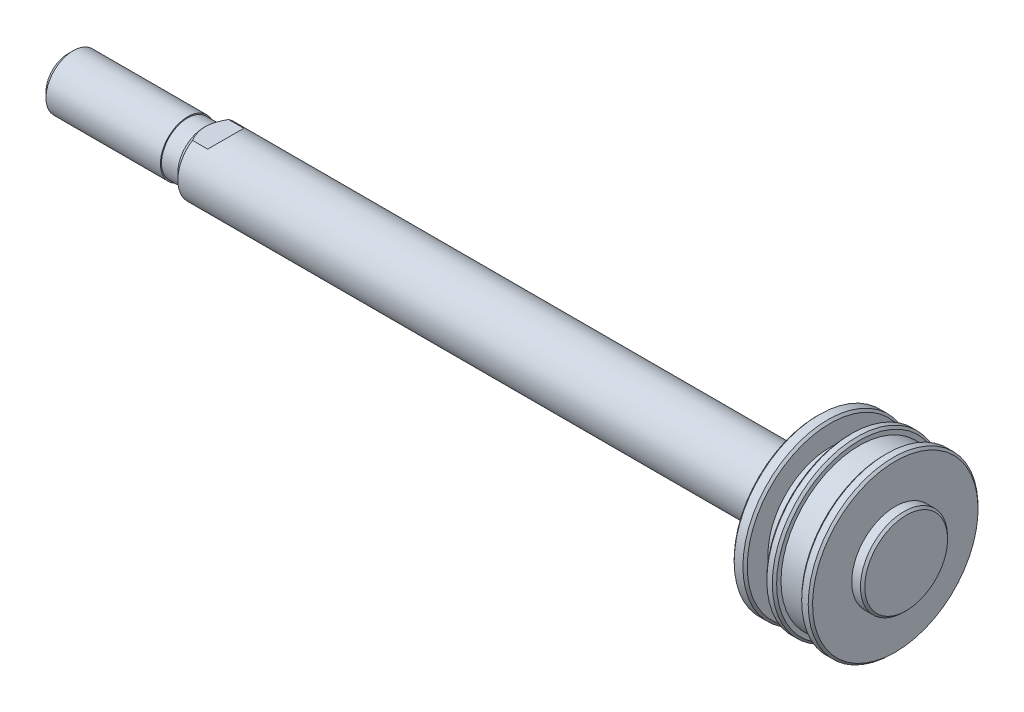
ISO-10303-21;
HEADER;
FILE_DESCRIPTION(('STEP AP214'),'2;1');
FILE_NAME('part.step','',(''),(''),'','','');
FILE_SCHEMA(('AUTOMOTIVE_DESIGN { 1 0 10303 214 1 1 1 1 }'));
ENDSEC;
DATA;
#1=APPLICATION_CONTEXT('core data for automotive mechanical design processes');
#2=APPLICATION_PROTOCOL_DEFINITION('international standard','automotive_design',2000,#1);
#3=PRODUCT_CONTEXT('',#1,'mechanical');
#4=PRODUCT('Part','Part','',(#3));
#5=PRODUCT_RELATED_PRODUCT_CATEGORY('part','',(#4));
#6=PRODUCT_DEFINITION_FORMATION('','',#4);
#7=PRODUCT_DEFINITION_CONTEXT('part definition',#1,'design');
#8=PRODUCT_DEFINITION('design','',#6,#7);
#9=PRODUCT_DEFINITION_SHAPE('','',#8);
#10=(LENGTH_UNIT() NAMED_UNIT(*) SI_UNIT(.MILLI.,.METRE.));
#11=(NAMED_UNIT(*) PLANE_ANGLE_UNIT() SI_UNIT($,.RADIAN.));
#12=(NAMED_UNIT(*) SI_UNIT($,.STERADIAN.) SOLID_ANGLE_UNIT());
#13=UNCERTAINTY_MEASURE_WITH_UNIT(LENGTH_MEASURE(1.E-05),#10,'distance_accuracy_value','');
#14=(GEOMETRIC_REPRESENTATION_CONTEXT(3) GLOBAL_UNCERTAINTY_ASSIGNED_CONTEXT((#13)) GLOBAL_UNIT_ASSIGNED_CONTEXT((#10,
#11,#12)) REPRESENTATION_CONTEXT('',''));
#15=CARTESIAN_POINT('',(0.,0.,0.));
#16=DIRECTION('',(0.,0.,1.));
#17=DIRECTION('',(1.,0.,0.));
#18=AXIS2_PLACEMENT_3D('',#15,#16,#17);
#19=CARTESIAN_POINT('',(61.,3.8,0.));
#20=DIRECTION('',(-1.,0.,0.));
#21=DIRECTION('',(0.,0.,1.));
#22=AXIS2_PLACEMENT_3D('',#19,#20,#21);
#23=PLANE('',#22);
#24=CARTESIAN_POINT('',(60.9999999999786,0.,0.));
#25=DIRECTION('',(-1.,0.,0.));
#26=DIRECTION('',(0.,0.,1.));
#27=AXIS2_PLACEMENT_3D('',#24,#25,#26);
#28=CIRCLE('',#27,3.80000000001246);
#29=CARTESIAN_POINT('',(60.9999999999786,0.,3.80000000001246));
#30=VERTEX_POINT('',#29);
#31=EDGE_CURVE('E20',#30,#30,#28,.T.);
#32=ORIENTED_EDGE('',*,*,#31,.F.);
#33=EDGE_LOOP('',(#32));
#34=FACE_BOUND('',#33,.T.);
#35=ADVANCED_FACE('F17',(#34),#23,.F.);
#36=CARTESIAN_POINT('',(60.8000000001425,0.,0.));
#37=DIRECTION('',(-1.,0.,0.));
#38=DIRECTION('',(0.,0.,1.));
#39=AXIS2_PLACEMENT_3D('',#36,#37,#38);
#40=CONICAL_SURFACE('',#39,3.99999999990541,0.785398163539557);
#41=CARTESIAN_POINT('',(60.8,0.,0.));
#42=DIRECTION('',(-1.,0.,0.));
#43=DIRECTION('',(0.,0.,1.));
#44=AXIS2_PLACEMENT_3D('',#41,#42,#43);
#45=CIRCLE('',#44,4.);
#46=CARTESIAN_POINT('',(60.8,0.,4.));
#47=VERTEX_POINT('',#46);
#48=EDGE_CURVE('E86',#47,#47,#45,.T.);
#49=ORIENTED_EDGE('',*,*,#48,.F.);
#50=EDGE_LOOP('',(#49));
#51=FACE_BOUND('',#50,.T.);
#52=ORIENTED_EDGE('',*,*,#31,.T.);
#53=EDGE_LOOP('',(#52));
#54=FACE_BOUND('',#53,.T.);
#55=ADVANCED_FACE('F210',(#51,#54),#40,.T.);
#56=CARTESIAN_POINT('',(61.,0.,0.));
#57=DIRECTION('',(-1.,0.,0.));
#58=DIRECTION('',(0.,0.,1.));
#59=AXIS2_PLACEMENT_3D('',#56,#57,#58);
#60=CYLINDRICAL_SURFACE('',#59,4.);
#61=CARTESIAN_POINT('',(60.,0.,0.));
#62=DIRECTION('',(-1.,0.,0.));
#63=DIRECTION('',(0.,0.,1.));
#64=AXIS2_PLACEMENT_3D('',#61,#62,#63);
#65=CIRCLE('',#64,4.);
#66=CARTESIAN_POINT('',(60.,0.,4.));
#67=VERTEX_POINT('',#66);
#68=EDGE_CURVE('E519',#67,#67,#65,.F.);
#69=ORIENTED_EDGE('',*,*,#68,.T.);
#70=EDGE_LOOP('',(#69));
#71=FACE_BOUND('',#70,.T.);
#72=ORIENTED_EDGE('',*,*,#48,.T.);
#73=EDGE_LOOP('',(#72));
#74=FACE_BOUND('',#73,.T.);
#75=ADVANCED_FACE('F207',(#71,#74),#60,.T.);
#76=CARTESIAN_POINT('',(60.,7.6,0.));
#77=DIRECTION('',(-1.,0.,0.));
#78=DIRECTION('',(0.,0.,1.));
#79=AXIS2_PLACEMENT_3D('',#76,#77,#78);
#80=PLANE('',#79);
#81=ORIENTED_EDGE('',*,*,#68,.F.);
#82=EDGE_LOOP('',(#81));
#83=FACE_BOUND('',#82,.T.);
#84=CARTESIAN_POINT('',(60.,0.,0.));
#85=DIRECTION('',(-1.,0.,0.));
#86=DIRECTION('',(0.,-1.,0.));
#87=AXIS2_PLACEMENT_3D('',#84,#85,#86);
#88=CIRCLE('',#87,7.6);
#89=CARTESIAN_POINT('',(60.,-7.6,0.));
#90=VERTEX_POINT('',#89);
#91=EDGE_CURVE('E516',#90,#90,#88,.T.);
#92=ORIENTED_EDGE('',*,*,#91,.F.);
#93=EDGE_LOOP('',(#92));
#94=FACE_BOUND('',#93,.T.);
#95=ADVANCED_FACE('F203',(#83,#94),#80,.F.);
#96=CARTESIAN_POINT('',(59.8,0.,0.));
#97=DIRECTION('',(-1.,0.,0.));
#98=DIRECTION('',(0.,-1.,0.));
#99=AXIS2_PLACEMENT_3D('',#96,#97,#98);
#100=CONICAL_SURFACE('',#99,7.8,0.78539816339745);
#101=ORIENTED_EDGE('',*,*,#91,.T.);
#102=EDGE_LOOP('',(#101));
#103=FACE_BOUND('',#102,.T.);
#104=CARTESIAN_POINT('',(59.8,0.,0.));
#105=DIRECTION('',(-1.,0.,0.));
#106=DIRECTION('',(0.,0.,1.));
#107=AXIS2_PLACEMENT_3D('',#104,#105,#106);
#108=CIRCLE('',#107,7.8);
#109=CARTESIAN_POINT('',(59.8,0.,7.8));
#110=VERTEX_POINT('',#109);
#111=EDGE_CURVE('E518',#110,#110,#108,.T.);
#112=ORIENTED_EDGE('',*,*,#111,.F.);
#113=EDGE_LOOP('',(#112));
#114=FACE_BOUND('',#113,.T.);
#115=ADVANCED_FACE('F199',(#103,#114),#100,.T.);
#116=CARTESIAN_POINT('',(61.,0.,0.));
#117=DIRECTION('',(-1.,0.,0.));
#118=DIRECTION('',(0.,0.,1.));
#119=AXIS2_PLACEMENT_3D('',#116,#117,#118);
#120=CYLINDRICAL_SURFACE('',#119,7.8);
#121=ORIENTED_EDGE('',*,*,#111,.T.);
#122=EDGE_LOOP('',(#121));
#123=FACE_BOUND('',#122,.T.);
#124=CARTESIAN_POINT('',(59.2,0.,0.));
#125=DIRECTION('',(1.,0.,0.));
#126=DIRECTION('',(0.,0.,-1.));
#127=AXIS2_PLACEMENT_3D('',#124,#125,#126);
#128=CIRCLE('',#127,7.8);
#129=CARTESIAN_POINT('',(59.2,0.,-7.8));
#130=VERTEX_POINT('',#129);
#131=EDGE_CURVE('E515',#130,#130,#128,.F.);
#132=ORIENTED_EDGE('',*,*,#131,.F.);
#133=EDGE_LOOP('',(#132));
#134=FACE_BOUND('',#133,.T.);
#135=ADVANCED_FACE('F195',(#123,#134),#120,.T.);
#136=CARTESIAN_POINT('',(59.2,0.,0.));
#137=DIRECTION('',(1.,0.,0.));
#138=DIRECTION('',(0.,1.,0.));
#139=AXIS2_PLACEMENT_3D('',#136,#137,#138);
#140=CONICAL_SURFACE('',#139,7.8,0.785398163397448);
#141=CARTESIAN_POINT('',(59.,0.,0.));
#142=DIRECTION('',(1.,0.,0.));
#143=DIRECTION('',(0.,1.,0.));
#144=AXIS2_PLACEMENT_3D('',#141,#142,#143);
#145=CIRCLE('',#144,7.6);
#146=CARTESIAN_POINT('',(59.,7.6,0.));
#147=VERTEX_POINT('',#146);
#148=EDGE_CURVE('E512',#147,#147,#145,.T.);
#149=ORIENTED_EDGE('',*,*,#148,.T.);
#150=EDGE_LOOP('',(#149));
#151=FACE_BOUND('',#150,.T.);
#152=ORIENTED_EDGE('',*,*,#131,.T.);
#153=EDGE_LOOP('',(#152));
#154=FACE_BOUND('',#153,.T.);
#155=ADVANCED_FACE('F191',(#151,#154),#140,.T.);
#156=CARTESIAN_POINT('',(59.,7.2,0.));
#157=DIRECTION('',(1.,0.,0.));
#158=DIRECTION('',(0.,0.,-1.));
#159=AXIS2_PLACEMENT_3D('',#156,#157,#158);
#160=PLANE('',#159);
#161=ORIENTED_EDGE('',*,*,#148,.F.);
#162=EDGE_LOOP('',(#161));
#163=FACE_BOUND('',#162,.T.);
#164=CARTESIAN_POINT('',(59.,0.,0.));
#165=DIRECTION('',(-1.,0.,0.));
#166=DIRECTION('',(0.,0.,1.));
#167=AXIS2_PLACEMENT_3D('',#164,#165,#166);
#168=CIRCLE('',#167,7.2);
#169=CARTESIAN_POINT('',(59.,0.,7.2));
#170=VERTEX_POINT('',#169);
#171=EDGE_CURVE('E509',#170,#170,#168,.T.);
#172=ORIENTED_EDGE('',*,*,#171,.F.);
#173=EDGE_LOOP('',(#172));
#174=FACE_BOUND('',#173,.T.);
#175=ADVANCED_FACE('F187',(#163,#174),#160,.F.);
#176=CARTESIAN_POINT('',(61.,0.,0.));
#177=DIRECTION('',(-1.,0.,0.));
#178=DIRECTION('',(0.,0.,1.));
#179=AXIS2_PLACEMENT_3D('',#176,#177,#178);
#180=CYLINDRICAL_SURFACE('',#179,7.2);
#181=CARTESIAN_POINT('',(56.7,0.,0.));
#182=DIRECTION('',(-1.,0.,0.));
#183=DIRECTION('',(0.,0.,1.));
#184=AXIS2_PLACEMENT_3D('',#181,#182,#183);
#185=CIRCLE('',#184,7.2);
#186=CARTESIAN_POINT('',(56.7,0.,7.2));
#187=VERTEX_POINT('',#186);
#188=EDGE_CURVE('E506',#187,#187,#185,.F.);
#189=ORIENTED_EDGE('',*,*,#188,.T.);
#190=EDGE_LOOP('',(#189));
#191=FACE_BOUND('',#190,.T.);
#192=ORIENTED_EDGE('',*,*,#171,.T.);
#193=EDGE_LOOP('',(#192));
#194=FACE_BOUND('',#193,.T.);
#195=ADVANCED_FACE('F183',(#191,#194),#180,.T.);
#196=CARTESIAN_POINT('',(56.7,7.6,0.));
#197=DIRECTION('',(-1.,0.,0.));
#198=DIRECTION('',(0.,0.,1.));
#199=AXIS2_PLACEMENT_3D('',#196,#197,#198);
#200=PLANE('',#199);
#201=ORIENTED_EDGE('',*,*,#188,.F.);
#202=EDGE_LOOP('',(#201));
#203=FACE_BOUND('',#202,.T.);
#204=CARTESIAN_POINT('',(56.7,0.,0.));
#205=DIRECTION('',(-1.,0.,0.));
#206=DIRECTION('',(0.,0.,1.));
#207=AXIS2_PLACEMENT_3D('',#204,#205,#206);
#208=CIRCLE('',#207,7.6);
#209=CARTESIAN_POINT('',(56.7,0.,7.6));
#210=VERTEX_POINT('',#209);
#211=EDGE_CURVE('E502',#210,#210,#208,.T.);
#212=ORIENTED_EDGE('',*,*,#211,.F.);
#213=EDGE_LOOP('',(#212));
#214=FACE_BOUND('',#213,.T.);
#215=ADVANCED_FACE('F179',(#203,#214),#200,.F.);
#216=CARTESIAN_POINT('',(56.5,0.,0.));
#217=DIRECTION('',(-1.,0.,0.));
#218=DIRECTION('',(0.,0.,1.));
#219=AXIS2_PLACEMENT_3D('',#216,#217,#218);
#220=CONICAL_SURFACE('',#219,7.80000000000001,0.785398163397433);
#221=ORIENTED_EDGE('',*,*,#211,.T.);
#222=EDGE_LOOP('',(#221));
#223=FACE_BOUND('',#222,.T.);
#224=CARTESIAN_POINT('',(56.5,0.,0.));
#225=DIRECTION('',(-1.,0.,0.));
#226=DIRECTION('',(0.,0.,1.));
#227=AXIS2_PLACEMENT_3D('',#224,#225,#226);
#228=CIRCLE('',#227,7.8);
#229=CARTESIAN_POINT('',(56.5,0.,7.8));
#230=VERTEX_POINT('',#229);
#231=EDGE_CURVE('E505',#230,#230,#228,.T.);
#232=ORIENTED_EDGE('',*,*,#231,.F.);
#233=EDGE_LOOP('',(#232));
#234=FACE_BOUND('',#233,.T.);
#235=ADVANCED_FACE('F175',(#223,#234),#220,.T.);
#236=CARTESIAN_POINT('',(61.,0.,0.));
#237=DIRECTION('',(-1.,0.,0.));
#238=DIRECTION('',(0.,0.,1.));
#239=AXIS2_PLACEMENT_3D('',#236,#237,#238);
#240=CYLINDRICAL_SURFACE('',#239,7.8);
#241=ORIENTED_EDGE('',*,*,#231,.T.);
#242=EDGE_LOOP('',(#241));
#243=FACE_BOUND('',#242,.T.);
#244=CARTESIAN_POINT('',(56.,0.,0.));
#245=DIRECTION('',(1.,0.,0.));
#246=DIRECTION('',(0.,0.,-1.));
#247=AXIS2_PLACEMENT_3D('',#244,#245,#246);
#248=CIRCLE('',#247,7.8);
#249=CARTESIAN_POINT('',(56.,0.,-7.8));
#250=VERTEX_POINT('',#249);
#251=EDGE_CURVE('E501',#250,#250,#248,.F.);
#252=ORIENTED_EDGE('',*,*,#251,.F.);
#253=EDGE_LOOP('',(#252));
#254=FACE_BOUND('',#253,.T.);
#255=ADVANCED_FACE('F171',(#243,#254),#240,.T.);
#256=CARTESIAN_POINT('',(56.,0.,0.));
#257=DIRECTION('',(1.,0.,0.));
#258=DIRECTION('',(0.,0.,-1.));
#259=AXIS2_PLACEMENT_3D('',#256,#257,#258);
#260=CONICAL_SURFACE('',#259,7.8,0.785398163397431);
#261=CARTESIAN_POINT('',(55.8,0.,0.));
#262=DIRECTION('',(1.,0.,0.));
#263=DIRECTION('',(0.,0.,-1.));
#264=AXIS2_PLACEMENT_3D('',#261,#262,#263);
#265=CIRCLE('',#264,7.6);
#266=CARTESIAN_POINT('',(55.8,0.,-7.6));
#267=VERTEX_POINT('',#266);
#268=EDGE_CURVE('E498',#267,#267,#265,.T.);
#269=ORIENTED_EDGE('',*,*,#268,.T.);
#270=EDGE_LOOP('',(#269));
#271=FACE_BOUND('',#270,.T.);
#272=ORIENTED_EDGE('',*,*,#251,.T.);
#273=EDGE_LOOP('',(#272));
#274=FACE_BOUND('',#273,.T.);
#275=ADVANCED_FACE('F167',(#271,#274),#260,.T.);
#276=CARTESIAN_POINT('',(55.8,5.7,0.));
#277=DIRECTION('',(1.,0.,0.));
#278=DIRECTION('',(0.,0.,-1.));
#279=AXIS2_PLACEMENT_3D('',#276,#277,#278);
#280=PLANE('',#279);
#281=ORIENTED_EDGE('',*,*,#268,.F.);
#282=EDGE_LOOP('',(#281));
#283=FACE_BOUND('',#282,.T.);
#284=CARTESIAN_POINT('',(55.8,0.,0.));
#285=DIRECTION('',(-1.,0.,0.));
#286=DIRECTION('',(0.,0.,1.));
#287=AXIS2_PLACEMENT_3D('',#284,#285,#286);
#288=CIRCLE('',#287,5.7);
#289=CARTESIAN_POINT('',(55.8,0.,5.7));
#290=VERTEX_POINT('',#289);
#291=EDGE_CURVE('E495',#290,#290,#288,.T.);
#292=ORIENTED_EDGE('',*,*,#291,.F.);
#293=EDGE_LOOP('',(#292));
#294=FACE_BOUND('',#293,.T.);
#295=ADVANCED_FACE('F163',(#283,#294),#280,.F.);
#296=CARTESIAN_POINT('',(61.,0.,0.));
#297=DIRECTION('',(-1.,0.,0.));
#298=DIRECTION('',(0.,0.,1.));
#299=AXIS2_PLACEMENT_3D('',#296,#297,#298);
#300=CYLINDRICAL_SURFACE('',#299,5.7);
#301=CARTESIAN_POINT('',(54.,0.,0.));
#302=DIRECTION('',(-1.,0.,0.));
#303=DIRECTION('',(0.,0.,1.));
#304=AXIS2_PLACEMENT_3D('',#301,#302,#303);
#305=CIRCLE('',#304,5.7);
#306=CARTESIAN_POINT('',(54.,0.,5.7));
#307=VERTEX_POINT('',#306);
#308=EDGE_CURVE('E492',#307,#307,#305,.F.);
#309=ORIENTED_EDGE('',*,*,#308,.T.);
#310=EDGE_LOOP('',(#309));
#311=FACE_BOUND('',#310,.T.);
#312=ORIENTED_EDGE('',*,*,#291,.T.);
#313=EDGE_LOOP('',(#312));
#314=FACE_BOUND('',#313,.T.);
#315=ADVANCED_FACE('F159',(#311,#314),#300,.T.);
#316=CARTESIAN_POINT('',(54.,7.6,0.));
#317=DIRECTION('',(-1.,0.,0.));
#318=DIRECTION('',(0.,0.,1.));
#319=AXIS2_PLACEMENT_3D('',#316,#317,#318);
#320=PLANE('',#319);
#321=ORIENTED_EDGE('',*,*,#308,.F.);
#322=EDGE_LOOP('',(#321));
#323=FACE_BOUND('',#322,.T.);
#324=CARTESIAN_POINT('',(54.,0.,0.));
#325=DIRECTION('',(-1.,0.,0.));
#326=DIRECTION('',(0.,0.,1.));
#327=AXIS2_PLACEMENT_3D('',#324,#325,#326);
#328=CIRCLE('',#327,7.6);
#329=CARTESIAN_POINT('',(54.,0.,7.6));
#330=VERTEX_POINT('',#329);
#331=EDGE_CURVE('E489',#330,#330,#328,.T.);
#332=ORIENTED_EDGE('',*,*,#331,.F.);
#333=EDGE_LOOP('',(#332));
#334=FACE_BOUND('',#333,.T.);
#335=ADVANCED_FACE('F155',(#323,#334),#320,.F.);
#336=CARTESIAN_POINT('',(53.8,0.,0.));
#337=DIRECTION('',(-1.,0.,0.));
#338=DIRECTION('',(0.,0.,1.));
#339=AXIS2_PLACEMENT_3D('',#336,#337,#338);
#340=CONICAL_SURFACE('',#339,7.8,0.78539816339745);
#341=ORIENTED_EDGE('',*,*,#331,.T.);
#342=EDGE_LOOP('',(#341));
#343=FACE_BOUND('',#342,.T.);
#344=CARTESIAN_POINT('',(53.8,0.,0.));
#345=DIRECTION('',(-1.,0.,0.));
#346=DIRECTION('',(0.,0.,1.));
#347=AXIS2_PLACEMENT_3D('',#344,#345,#346);
#348=CIRCLE('',#347,7.8);
#349=CARTESIAN_POINT('',(53.8,0.,7.8));
#350=VERTEX_POINT('',#349);
#351=EDGE_CURVE('E488',#350,#350,#348,.T.);
#352=ORIENTED_EDGE('',*,*,#351,.F.);
#353=EDGE_LOOP('',(#352));
#354=FACE_BOUND('',#353,.T.);
#355=ADVANCED_FACE('F151',(#343,#354),#340,.T.);
#356=CARTESIAN_POINT('',(-16.,0.,0.));
#357=DIRECTION('',(1.,0.,0.));
#358=DIRECTION('',(0.,0.,-1.));
#359=AXIS2_PLACEMENT_3D('',#356,#357,#358);
#360=PLANE('',#359);
#361=CARTESIAN_POINT('',(-15.9999999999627,0.,0.));
#362=DIRECTION('',(1.,0.,0.));
#363=DIRECTION('',(0.,0.,-1.));
#364=AXIS2_PLACEMENT_3D('',#361,#362,#363);
#365=CIRCLE('',#364,2.00949999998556);
#366=CARTESIAN_POINT('',(-15.9999999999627,0.,-2.00949999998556));
#367=VERTEX_POINT('',#366);
#368=EDGE_CURVE('E484',#367,#367,#365,.T.);
#369=ORIENTED_EDGE('',*,*,#368,.F.);
#370=EDGE_LOOP('',(#369));
#371=FACE_BOUND('',#370,.T.);
#372=ADVANCED_FACE('F147',(#371),#360,.F.);
#373=CARTESIAN_POINT('',(61.,0.,0.));
#374=DIRECTION('',(-1.,0.,0.));
#375=DIRECTION('',(0.,0.,1.));
#376=AXIS2_PLACEMENT_3D('',#373,#374,#375);
#377=CYLINDRICAL_SURFACE('',#376,7.8);
#378=ORIENTED_EDGE('',*,*,#351,.T.);
#379=EDGE_LOOP('',(#378));
#380=FACE_BOUND('',#379,.T.);
#381=CARTESIAN_POINT('',(53.,0.,0.));
#382=DIRECTION('',(1.,0.,0.));
#383=DIRECTION('',(0.,0.,-1.));
#384=AXIS2_PLACEMENT_3D('',#381,#382,#383);
#385=CIRCLE('',#384,7.8);
#386=CARTESIAN_POINT('',(53.,0.,-7.8));
#387=VERTEX_POINT('',#386);
#388=EDGE_CURVE('E487',#387,#387,#385,.F.);
#389=ORIENTED_EDGE('',*,*,#388,.F.);
#390=EDGE_LOOP('',(#389));
#391=FACE_BOUND('',#390,.T.);
#392=ADVANCED_FACE('F143',(#380,#391),#377,.T.);
#393=CARTESIAN_POINT('',(-15.5094999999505,0.,0.));
#394=DIRECTION('',(1.,0.,0.));
#395=DIRECTION('',(0.,0.,-1.));
#396=AXIS2_PLACEMENT_3D('',#393,#394,#395);
#397=CONICAL_SURFACE('',#396,2.49999999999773,0.785398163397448);
#398=CARTESIAN_POINT('',(-15.5095,0.,0.));
#399=DIRECTION('',(-1.,0.,0.));
#400=DIRECTION('',(0.,0.,1.));
#401=AXIS2_PLACEMENT_3D('',#398,#399,#400);
#402=CIRCLE('',#401,2.5);
#403=CARTESIAN_POINT('',(-15.5095,0.,2.5));
#404=VERTEX_POINT('',#403);
#405=EDGE_CURVE('E483',#404,#404,#402,.F.);
#406=ORIENTED_EDGE('',*,*,#405,.F.);
#407=EDGE_LOOP('',(#406));
#408=FACE_BOUND('',#407,.T.);
#409=ORIENTED_EDGE('',*,*,#368,.T.);
#410=EDGE_LOOP('',(#409));
#411=FACE_BOUND('',#410,.T.);
#412=ADVANCED_FACE('F139',(#408,#411),#397,.T.);
#413=CARTESIAN_POINT('',(53.,0.,0.));
#414=DIRECTION('',(1.,0.,0.));
#415=DIRECTION('',(0.,0.,-1.));
#416=AXIS2_PLACEMENT_3D('',#413,#414,#415);
#417=CONICAL_SURFACE('',#416,7.8,0.785398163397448);
#418=CARTESIAN_POINT('',(52.8,0.,0.));
#419=DIRECTION('',(1.,0.,0.));
#420=DIRECTION('',(0.,0.,-1.));
#421=AXIS2_PLACEMENT_3D('',#418,#419,#420);
#422=CIRCLE('',#421,7.6);
#423=CARTESIAN_POINT('',(52.8,0.,-7.6));
#424=VERTEX_POINT('',#423);
#425=EDGE_CURVE('E480',#424,#424,#422,.T.);
#426=ORIENTED_EDGE('',*,*,#425,.T.);
#427=EDGE_LOOP('',(#426));
#428=FACE_BOUND('',#427,.T.);
#429=ORIENTED_EDGE('',*,*,#388,.T.);
#430=EDGE_LOOP('',(#429));
#431=FACE_BOUND('',#430,.T.);
#432=ADVANCED_FACE('F135',(#428,#431),#417,.T.);
#433=CARTESIAN_POINT('',(61.,0.,0.));
#434=DIRECTION('',(-1.,0.,0.));
#435=DIRECTION('',(0.,0.,1.));
#436=AXIS2_PLACEMENT_3D('',#433,#434,#435);
#437=CYLINDRICAL_SURFACE('',#436,2.5);
#438=ORIENTED_EDGE('',*,*,#405,.T.);
#439=EDGE_LOOP('',(#438));
#440=FACE_BOUND('',#439,.T.);
#441=CARTESIAN_POINT('',(-5.,0.,0.));
#442=DIRECTION('',(-1.,0.,0.));
#443=DIRECTION('',(0.,0.,1.));
#444=AXIS2_PLACEMENT_3D('',#441,#442,#443);
#445=CIRCLE('',#444,2.5);
#446=CARTESIAN_POINT('',(-5.,0.,2.5));
#447=VERTEX_POINT('',#446);
#448=EDGE_CURVE('E477',#447,#447,#445,.T.);
#449=ORIENTED_EDGE('',*,*,#448,.T.);
#450=EDGE_LOOP('',(#449));
#451=FACE_BOUND('',#450,.T.);
#452=ADVANCED_FACE('F131',(#440,#451),#437,.T.);
#453=CARTESIAN_POINT('',(52.8,2.9,0.));
#454=DIRECTION('',(1.,0.,0.));
#455=DIRECTION('',(0.,0.,-1.));
#456=AXIS2_PLACEMENT_3D('',#453,#454,#455);
#457=PLANE('',#456);
#458=ORIENTED_EDGE('',*,*,#425,.F.);
#459=EDGE_LOOP('',(#458));
#460=FACE_BOUND('',#459,.T.);
#461=CARTESIAN_POINT('',(52.8,0.,0.));
#462=DIRECTION('',(-1.,0.,0.));
#463=DIRECTION('',(0.,0.,1.));
#464=AXIS2_PLACEMENT_3D('',#461,#462,#463);
#465=CIRCLE('',#464,2.9);
#466=CARTESIAN_POINT('',(52.8,0.,2.9));
#467=VERTEX_POINT('',#466);
#468=EDGE_CURVE('E472',#467,#467,#465,.T.);
#469=ORIENTED_EDGE('',*,*,#468,.F.);
#470=EDGE_LOOP('',(#469));
#471=FACE_BOUND('',#470,.T.);
#472=ADVANCED_FACE('F127',(#460,#471),#457,.F.);
#473=CARTESIAN_POINT('',(-5.,2.5,0.));
#474=DIRECTION('',(-1.,0.,0.));
#475=DIRECTION('',(0.,0.,1.));
#476=AXIS2_PLACEMENT_3D('',#473,#474,#475);
#477=PLANE('',#476);
#478=CARTESIAN_POINT('',(-5.,0.,0.));
#479=DIRECTION('',(-1.,0.,0.));
#480=DIRECTION('',(0.,0.,1.));
#481=AXIS2_PLACEMENT_3D('',#478,#479,#480);
#482=CIRCLE('',#481,2.4);
#483=CARTESIAN_POINT('',(-5.,0.,2.4));
#484=VERTEX_POINT('',#483);
#485=EDGE_CURVE('E116',#484,#484,#482,.F.);
#486=ORIENTED_EDGE('',*,*,#485,.F.);
#487=EDGE_LOOP('',(#486));
#488=FACE_BOUND('',#487,.T.);
#489=ORIENTED_EDGE('',*,*,#448,.F.);
#490=EDGE_LOOP('',(#489));
#491=FACE_BOUND('',#490,.T.);
#492=ADVANCED_FACE('F124',(#488,#491),#477,.F.);
#493=CARTESIAN_POINT('',(-1.5,-2.5,-6.));
#494=DIRECTION('',(0.,1.,0.));
#495=DIRECTION('',(0.,0.,1.));
#496=AXIS2_PLACEMENT_3D('',#493,#494,#495);
#497=PLANE('',#496);
#498=DIRECTION('',(1.,0.,0.));
#499=VECTOR('',#498,1.);
#500=CARTESIAN_POINT('',(-1.5,-2.5,1.6583123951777));
#501=LINE('',#500,#499);
#502=CARTESIAN_POINT('',(-2.89999999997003,-2.5,1.6583123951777));
#503=VERTEX_POINT('',#502);
#504=CARTESIAN_POINT('',(-1.5,-2.5,1.6583123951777));
#505=VERTEX_POINT('',#504);
#506=EDGE_CURVE('E62',#503,#505,#501,.T.);
#507=ORIENTED_EDGE('',*,*,#506,.F.);
#508=CARTESIAN_POINT('',(-2.89999999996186,-2.50000000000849,-1.65831239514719));
#509=CARTESIAN_POINT('',(-2.9490987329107,-2.50000000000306,-1.56939801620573));
#510=CARTESIAN_POINT('',(-2.99621393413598,-2.50000000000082,-1.47928496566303));
#511=CARTESIAN_POINT('',(-3.08517448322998,-2.49999999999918,-1.2960563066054));
#512=CARTESIAN_POINT('',(-3.12699761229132,-2.49999999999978,-1.20292997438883));
#513=CARTESIAN_POINT('',(-3.20400289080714,-2.50000000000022,-1.01291201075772));
#514=CARTESIAN_POINT('',(-3.23911984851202,-2.50000000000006,-0.91599346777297));
#515=CARTESIAN_POINT('',(-3.30021822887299,-2.49999999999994,-0.719415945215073));
#516=CARTESIAN_POINT('',(-3.32621409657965,-2.49999999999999,-0.619761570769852));
#517=CARTESIAN_POINT('',(-3.36165638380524,-2.50000000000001,-0.4454022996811));
#518=CARTESIAN_POINT('',(-3.37367559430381,-2.5,-0.371220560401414));
#519=CARTESIAN_POINT('',(-3.39124737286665,-2.5,-0.222075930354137));
#520=CARTESIAN_POINT('',(-3.39679967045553,-2.5,-0.147113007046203));
#521=CARTESIAN_POINT('',(-3.40111068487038,-2.5,0.00254107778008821));
#522=CARTESIAN_POINT('',(-3.39991168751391,-2.5,0.0772310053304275));
#523=CARTESIAN_POINT('',(-3.39088945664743,-2.5,0.226204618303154));
#524=CARTESIAN_POINT('',(-3.38306581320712,-2.5,0.300488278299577));
#525=CARTESIAN_POINT('',(-3.35846202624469,-2.5,0.466631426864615));
#526=CARTESIAN_POINT('',(-3.33992896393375,-2.5,0.558231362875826));
#527=CARTESIAN_POINT('',(-3.29445050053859,-2.5,0.739318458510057));
#528=CARTESIAN_POINT('',(-3.26750066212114,-2.5,0.828804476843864));
#529=CARTESIAN_POINT('',(-3.20653999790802,-2.5,1.00581895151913));
#530=CARTESIAN_POINT('',(-3.17249340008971,-2.5,1.09333490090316));
#531=CARTESIAN_POINT('',(-3.09883783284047,-2.5,1.26594005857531));
#532=CARTESIAN_POINT('',(-3.05923039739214,-2.5,1.35102992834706));
#533=CARTESIAN_POINT('',(-2.99863633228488,-2.5,1.4727456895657));
#534=CARTESIAN_POINT('',(-2.97940430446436,-2.5,1.51026031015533));
#535=CARTESIAN_POINT('',(-2.94023130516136,-2.5,1.58468482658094));
#536=CARTESIAN_POINT('',(-2.92029424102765,-2.5,1.62159677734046));
#537=CARTESIAN_POINT('',(-2.8999999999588,-2.5,1.65831239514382));
#538=B_SPLINE_CURVE_WITH_KNOTS('',3,(#508,#509,#510,#511,#512,#513,#514,#515,#516,#517,#518,
#519,#520,#521,#522,#523,#524,#525,#526,#527,#528,#529,#530,#531,#532,#533,#534,#535,#536,#537),
.UNSPECIFIED.,.F.,.F.,(4,2,2,2,2,2,2,2,2,2,2,2,2,2,4),(0.,0.304820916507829,0.610881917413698,
0.919781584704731,1.22818981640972,1.45338435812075,1.67858831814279,1.90238331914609,
2.12619216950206,2.40607629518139,2.68610822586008,2.96758738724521,3.24898905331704,
3.37545306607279,3.50130138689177),.UNSPECIFIED.);
#539=CARTESIAN_POINT('',(-2.89999999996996,-2.5,-1.6583123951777));
#540=VERTEX_POINT('',#539);
#541=EDGE_CURVE('E110',#540,#503,#538,.T.);
#542=ORIENTED_EDGE('',*,*,#541,.F.);
#543=DIRECTION('',(1.,0.,0.));
#544=VECTOR('',#543,1.);
#545=CARTESIAN_POINT('',(-1.5,-2.5,-1.6583123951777));
#546=LINE('',#545,#544);
#547=CARTESIAN_POINT('',(-1.5,-2.5,-1.6583123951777));
#548=VERTEX_POINT('',#547);
#549=EDGE_CURVE('E57',#548,#540,#546,.F.);
#550=ORIENTED_EDGE('',*,*,#549,.F.);
#551=DIRECTION('',(0.,0.,1.));
#552=VECTOR('',#551,1.);
#553=CARTESIAN_POINT('',(-1.5,-2.5,-6.));
#554=LINE('',#553,#552);
#555=EDGE_CURVE('E71',#548,#505,#554,.T.);
#556=ORIENTED_EDGE('',*,*,#555,.T.);
#557=EDGE_LOOP('',(#507,#542,#550,#556));
#558=FACE_BOUND('',#557,.T.);
#559=ADVANCED_FACE('F118',(#558),#497,.F.);
#560=CARTESIAN_POINT('',(61.,0.,0.));
#561=DIRECTION('',(-1.,0.,0.));
#562=DIRECTION('',(0.,0.,1.));
#563=AXIS2_PLACEMENT_3D('',#560,#561,#562);
#564=CYLINDRICAL_SURFACE('',#563,2.9);
#565=CARTESIAN_POINT('',(51.6,0.,0.));
#566=DIRECTION('',(-1.,0.,0.));
#567=DIRECTION('',(0.,0.,1.));
#568=AXIS2_PLACEMENT_3D('',#565,#566,#567);
#569=CIRCLE('',#568,2.9);
#570=CARTESIAN_POINT('',(51.6,0.,2.9));
#571=VERTEX_POINT('',#570);
#572=EDGE_CURVE('E78',#571,#571,#569,.F.);
#573=ORIENTED_EDGE('',*,*,#572,.T.);
#574=EDGE_LOOP('',(#573));
#575=FACE_BOUND('',#574,.T.);
#576=ORIENTED_EDGE('',*,*,#468,.T.);
#577=EDGE_LOOP('',(#576));
#578=FACE_BOUND('',#577,.T.);
#579=ADVANCED_FACE('F123',(#575,#578),#564,.T.);
#580=CARTESIAN_POINT('',(61.,0.,0.));
#581=DIRECTION('',(-1.,0.,0.));
#582=DIRECTION('',(0.,0.,1.));
#583=AXIS2_PLACEMENT_3D('',#580,#581,#582);
#584=CYLINDRICAL_SURFACE('',#583,2.4);
#585=ORIENTED_EDGE('',*,*,#485,.T.);
#586=EDGE_LOOP('',(#585));
#587=FACE_BOUND('',#586,.T.);
#588=CARTESIAN_POINT('',(-3.49999999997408,0.,0.));
#589=DIRECTION('',(1.,0.,0.));
#590=DIRECTION('',(0.,0.,-1.));
#591=AXIS2_PLACEMENT_3D('',#588,#589,#590);
#592=CIRCLE('',#591,2.40000000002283);
#593=CARTESIAN_POINT('',(-3.49999999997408,0.,-2.40000000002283));
#594=VERTEX_POINT('',#593);
#595=EDGE_CURVE('E77',#594,#594,#592,.T.);
#596=ORIENTED_EDGE('',*,*,#595,.F.);
#597=EDGE_LOOP('',(#596));
#598=FACE_BOUND('',#597,.T.);
#599=ADVANCED_FACE('F255',(#587,#598),#584,.T.);
#600=CARTESIAN_POINT('',(-18.5,2.5,-6.));
#601=DIRECTION('',(0.,-1.,0.));
#602=DIRECTION('',(0.,0.,-1.));
#603=AXIS2_PLACEMENT_3D('',#600,#601,#602);
#604=PLANE('',#603);
#605=DIRECTION('',(1.,0.,0.));
#606=VECTOR('',#605,1.);
#607=CARTESIAN_POINT('',(-18.5,2.5,-1.6583123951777));
#608=LINE('',#607,#606);
#609=CARTESIAN_POINT('',(-2.89999999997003,2.5,-1.6583123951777));
#610=VERTEX_POINT('',#609);
#611=CARTESIAN_POINT('',(-1.5,2.5,-1.6583123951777));
#612=VERTEX_POINT('',#611);
#613=EDGE_CURVE('E65',#610,#612,#608,.T.);
#614=ORIENTED_EDGE('',*,*,#613,.F.);
#615=CARTESIAN_POINT('',(-2.89999999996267,2.5000000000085,1.65831239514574));
#616=CARTESIAN_POINT('',(-2.94909873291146,2.50000000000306,1.56939801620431));
#617=CARTESIAN_POINT('',(-2.99621393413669,2.50000000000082,1.47928496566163));
#618=CARTESIAN_POINT('',(-3.0851744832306,2.49999999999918,1.29605630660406));
#619=CARTESIAN_POINT('',(-3.1269976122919,2.49999999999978,1.2029299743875));
#620=CARTESIAN_POINT('',(-3.20400289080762,2.50000000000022,1.01291201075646));
#621=CARTESIAN_POINT('',(-3.23911984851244,2.50000000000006,0.915993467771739));
#622=CARTESIAN_POINT('',(-3.30021822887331,2.49999999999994,0.719415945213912));
#623=CARTESIAN_POINT('',(-3.32621409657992,2.49999999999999,0.619761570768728));
#624=CARTESIAN_POINT('',(-3.36165638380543,2.50000000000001,0.445402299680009));
#625=CARTESIAN_POINT('',(-3.37367559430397,2.5,0.371220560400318));
#626=CARTESIAN_POINT('',(-3.39124737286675,2.5,0.222075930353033));
#627=CARTESIAN_POINT('',(-3.3967996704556,2.5,0.147113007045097));
#628=CARTESIAN_POINT('',(-3.40111068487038,2.5,-0.00254107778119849));
#629=CARTESIAN_POINT('',(-3.39991168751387,2.5,-0.0772310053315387));
#630=CARTESIAN_POINT('',(-3.39088945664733,2.5,-0.226204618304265));
#631=CARTESIAN_POINT('',(-3.38306581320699,2.5,-0.300488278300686));
#632=CARTESIAN_POINT('',(-3.35846202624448,2.5,-0.466631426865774));
#633=CARTESIAN_POINT('',(-3.33992896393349,2.5,-0.558231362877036));
#634=CARTESIAN_POINT('',(-3.29445050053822,2.5,-0.739318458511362));
#635=CARTESIAN_POINT('',(-3.26750066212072,2.5,-0.828804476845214));
#636=CARTESIAN_POINT('',(-3.20653999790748,2.5,-1.00581895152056));
#637=CARTESIAN_POINT('',(-3.17249340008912,2.5,-1.09333490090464));
#638=CARTESIAN_POINT('',(-3.09883783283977,2.5,-1.26594005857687));
#639=CARTESIAN_POINT('',(-3.05923039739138,2.5,-1.35102992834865));
#640=CARTESIAN_POINT('',(-2.9986363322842,2.5,-1.47274568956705));
#641=CARTESIAN_POINT('',(-2.9794043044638,2.5,-1.5102603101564));
#642=CARTESIAN_POINT('',(-2.94023130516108,2.5,-1.58468482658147));
#643=CARTESIAN_POINT('',(-2.9202942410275,2.5,-1.62159677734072));
#644=CARTESIAN_POINT('',(-2.8999999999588,2.5,-1.65831239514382));
#645=B_SPLINE_CURVE_WITH_KNOTS('',3,(#615,#616,#617,#618,#619,#620,#621,#622,#623,#624,#625,
#626,#627,#628,#629,#630,#631,#632,#633,#634,#635,#636,#637,#638,#639,#640,#641,#642,#643,#644),
.UNSPECIFIED.,.F.,.F.,(4,2,2,2,2,2,2,2,2,2,2,2,2,2,4),(0.,0.304820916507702,0.610881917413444,
0.91978158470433,1.22818981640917,1.45338435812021,1.67858831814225,1.90238331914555,
2.12619216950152,2.40607629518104,2.6861082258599,2.9675873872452,3.24898905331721,
3.37545306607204,3.50130138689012),.UNSPECIFIED.);
#646=CARTESIAN_POINT('',(-2.89999999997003,2.5,1.6583123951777));
#647=VERTEX_POINT('',#646);
#648=EDGE_CURVE('E92',#647,#610,#645,.T.);
#649=ORIENTED_EDGE('',*,*,#648,.F.);
#650=DIRECTION('',(1.,0.,0.));
#651=VECTOR('',#650,1.);
#652=CARTESIAN_POINT('',(-18.5,2.5,1.6583123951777));
#653=LINE('',#652,#651);
#654=CARTESIAN_POINT('',(-1.5,2.5,1.6583123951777));
#655=VERTEX_POINT('',#654);
#656=EDGE_CURVE('E34',#655,#647,#653,.F.);
#657=ORIENTED_EDGE('',*,*,#656,.F.);
#658=DIRECTION('',(0.,0.,1.));
#659=VECTOR('',#658,1.);
#660=CARTESIAN_POINT('',(-1.5,2.5,-6.));
#661=LINE('',#660,#659);
#662=EDGE_CURVE('E74',#655,#612,#661,.F.);
#663=ORIENTED_EDGE('',*,*,#662,.T.);
#664=EDGE_LOOP('',(#614,#649,#657,#663));
#665=FACE_BOUND('',#664,.T.);
#666=ADVANCED_FACE('F75',(#665),#604,.F.);
#667=CARTESIAN_POINT('',(-1.,-3.,-6.));
#668=DIRECTION('',(0.707106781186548,0.707106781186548,0.));
#669=DIRECTION('',(-0.707106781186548,0.707106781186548,0.));
#670=AXIS2_PLACEMENT_3D('',#667,#668,#669);
#671=PLANE('',#670);
#672=CARTESIAN_POINT('',(-4.,0.,0.));
#673=DIRECTION('',(0.707106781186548,0.707106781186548,0.));
#674=DIRECTION('',(-0.707106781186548,0.707106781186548,0.));
#675=AXIS2_PLACEMENT_3D('',#672,#673,#674);
#676=ELLIPSE('',#675,4.24264068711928,3.);
#677=EDGE_CURVE('E90',#505,#548,#676,.T.);
#678=ORIENTED_EDGE('',*,*,#677,.F.);
#679=ORIENTED_EDGE('',*,*,#555,.F.);
#680=EDGE_LOOP('',(#678,#679));
#681=FACE_BOUND('',#680,.T.);
#682=ADVANCED_FACE('F242',(#681),#671,.F.);
#683=CARTESIAN_POINT('',(51.6,3.,0.));
#684=DIRECTION('',(-1.,0.,0.));
#685=DIRECTION('',(0.,0.,1.));
#686=AXIS2_PLACEMENT_3D('',#683,#684,#685);
#687=PLANE('',#686);
#688=ORIENTED_EDGE('',*,*,#572,.F.);
#689=EDGE_LOOP('',(#688));
#690=FACE_BOUND('',#689,.T.);
#691=CARTESIAN_POINT('',(51.6,0.,0.));
#692=DIRECTION('',(-1.,0.,0.));
#693=DIRECTION('',(0.,0.,1.));
#694=AXIS2_PLACEMENT_3D('',#691,#692,#693);
#695=CIRCLE('',#694,3.);
#696=CARTESIAN_POINT('',(51.6,0.,3.));
#697=VERTEX_POINT('',#696);
#698=EDGE_CURVE('E82',#697,#697,#695,.T.);
#699=ORIENTED_EDGE('',*,*,#698,.F.);
#700=EDGE_LOOP('',(#699));
#701=FACE_BOUND('',#700,.T.);
#702=ADVANCED_FACE('F236',(#690,#701),#687,.F.);
#703=CARTESIAN_POINT('',(-1.5,2.5,-6.));
#704=DIRECTION('',(0.707106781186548,-0.707106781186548,0.));
#705=DIRECTION('',(0.707106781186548,0.707106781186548,0.));
#706=AXIS2_PLACEMENT_3D('',#703,#704,#705);
#707=PLANE('',#706);
#708=CARTESIAN_POINT('',(-4.,0.,0.));
#709=DIRECTION('',(0.707106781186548,-0.707106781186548,0.));
#710=DIRECTION('',(-0.707106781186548,-0.707106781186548,0.));
#711=AXIS2_PLACEMENT_3D('',#708,#709,#710);
#712=ELLIPSE('',#711,4.24264068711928,3.);
#713=EDGE_CURVE('E26',#612,#655,#712,.T.);
#714=ORIENTED_EDGE('',*,*,#713,.F.);
#715=ORIENTED_EDGE('',*,*,#662,.F.);
#716=EDGE_LOOP('',(#714,#715));
#717=FACE_BOUND('',#716,.T.);
#718=ADVANCED_FACE('F80',(#717),#707,.F.);
#719=CARTESIAN_POINT('',(-2.900000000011,0.,0.));
#720=DIRECTION('',(1.,0.,0.));
#721=DIRECTION('',(0.,0.,-1.));
#722=AXIS2_PLACEMENT_3D('',#719,#720,#721);
#723=CONICAL_SURFACE('',#722,2.99999999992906,0.785398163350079);
#724=ORIENTED_EDGE('',*,*,#541,.T.);
#725=CARTESIAN_POINT('',(-2.89999999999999,0.,0.));
#726=DIRECTION('',(-1.,0.,0.));
#727=DIRECTION('',(0.,0.,1.));
#728=AXIS2_PLACEMENT_3D('',#725,#726,#727);
#729=CIRCLE('',#728,3.);
#730=EDGE_CURVE('E11',#647,#503,#729,.F.);
#731=ORIENTED_EDGE('',*,*,#730,.F.);
#732=ORIENTED_EDGE('',*,*,#648,.T.);
#733=CARTESIAN_POINT('',(-2.89999999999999,0.,0.));
#734=DIRECTION('',(-1.,0.,0.));
#735=DIRECTION('',(0.,0.,1.));
#736=AXIS2_PLACEMENT_3D('',#733,#734,#735);
#737=CIRCLE('',#736,3.);
#738=EDGE_CURVE('E50',#540,#610,#737,.F.);
#739=ORIENTED_EDGE('',*,*,#738,.F.);
#740=EDGE_LOOP('',(#724,#731,#732,#739));
#741=FACE_BOUND('',#740,.T.);
#742=ORIENTED_EDGE('',*,*,#595,.T.);
#743=EDGE_LOOP('',(#742));
#744=FACE_BOUND('',#743,.T.);
#745=ADVANCED_FACE('F103',(#741,#744),#723,.T.);
#746=CARTESIAN_POINT('',(61.,0.,0.));
#747=DIRECTION('',(-1.,0.,0.));
#748=DIRECTION('',(0.,0.,1.));
#749=AXIS2_PLACEMENT_3D('',#746,#747,#748);
#750=CYLINDRICAL_SURFACE('',#749,3.);
#751=ORIENTED_EDGE('',*,*,#549,.T.);
#752=ORIENTED_EDGE('',*,*,#738,.T.);
#753=ORIENTED_EDGE('',*,*,#613,.T.);
#754=ORIENTED_EDGE('',*,*,#713,.T.);
#755=ORIENTED_EDGE('',*,*,#656,.T.);
#756=ORIENTED_EDGE('',*,*,#730,.T.);
#757=ORIENTED_EDGE('',*,*,#506,.T.);
#758=ORIENTED_EDGE('',*,*,#677,.T.);
#759=EDGE_LOOP('',(#751,#752,#753,#754,#755,#756,#757,#758));
#760=FACE_BOUND('',#759,.T.);
#761=ORIENTED_EDGE('',*,*,#698,.T.);
#762=EDGE_LOOP('',(#761));
#763=FACE_BOUND('',#762,.T.);
#764=ADVANCED_FACE('F67',(#760,#763),#750,.T.);
#765=CLOSED_SHELL('',(#35,#55,#75,#95,#115,#135,#155,#175,#195,#215,#235,#255,#275,#295,#315,
#335,#355,#372,#392,#412,#432,#452,#472,#492,#559,#579,#599,#666,#682,#702,#718,#745,#764));
#766=MANIFOLD_SOLID_BREP('B1',#765);
#767=ADVANCED_BREP_SHAPE_REPRESENTATION('',(#18,#766),#14);
#768=SHAPE_DEFINITION_REPRESENTATION(#9,#767);
ENDSEC;
END-ISO-10303-21;
